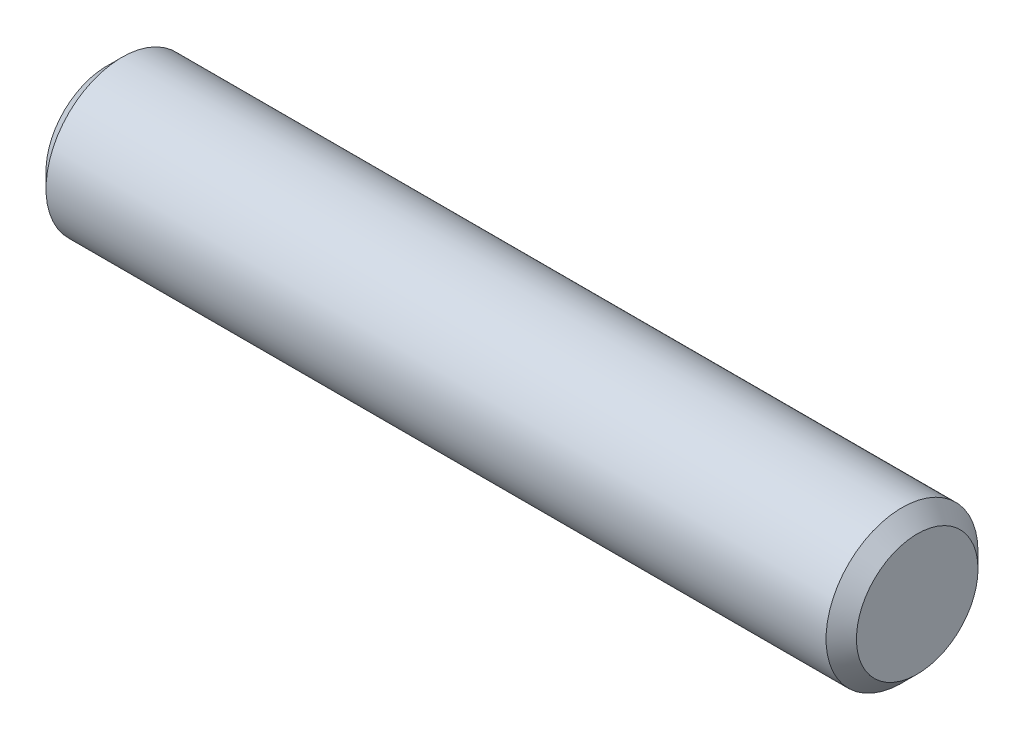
from build123d import *

# Parameters (mm, degrees)
EXTRUDE1_DEPTH      = 3.175
EXTRUDE1_DEPTH_BACK = 3.175
SKETCH2_R           = 0.5953125
CHAMFER1_SIZE       = 0.1190625


with BuildPart() as part:
    # Sketch2 → Extrude1 (new, two sides: drawn at the far end of the back side and taken through both)
    with BuildSketch(Plane(origin=(0, 0, 0), x_dir=(0, 0, -1), z_dir=(1, 0, 0)).offset(-EXTRUDE1_DEPTH_BACK)):
        Circle(SKETCH2_R)
    extrude(amount=EXTRUDE1_DEPTH + EXTRUDE1_DEPTH_BACK)

    # Chamfer1
    chamfer1_edges = [part.edges().sort_by_distance(p)[0] for p in [
        (-3.175, 0, 0.5953125),
        (3.175, 0, 0.5953125),
    ]]
    chamfer(chamfer1_edges, length=CHAMFER1_SIZE)


solid = part.part
